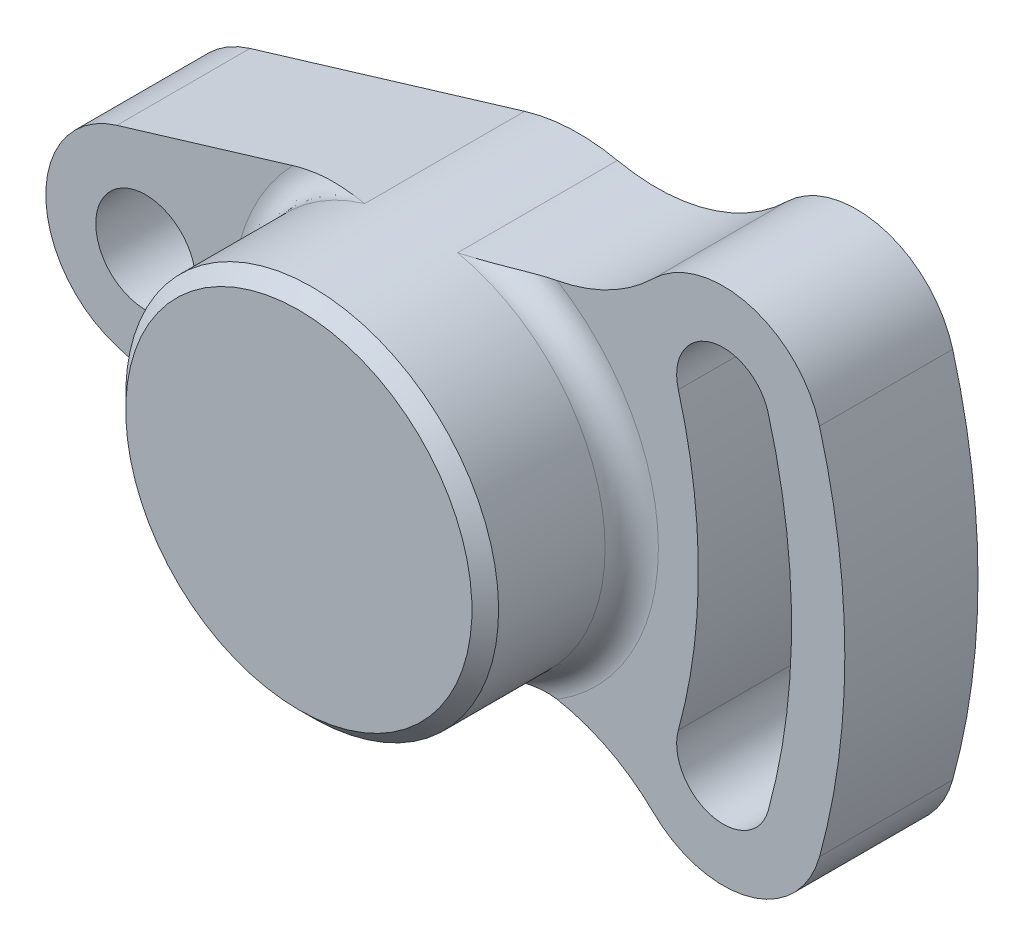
ISO-10303-21;
HEADER;
FILE_DESCRIPTION(('STEP AP214'),'2;1');
FILE_NAME('part.step','',(''),(''),'','','');
FILE_SCHEMA(('AUTOMOTIVE_DESIGN { 1 0 10303 214 1 1 1 1 }'));
ENDSEC;
DATA;
#1=APPLICATION_CONTEXT('core data for automotive mechanical design processes');
#2=APPLICATION_PROTOCOL_DEFINITION('international standard','automotive_design',2000,#1);
#3=PRODUCT_CONTEXT('',#1,'mechanical');
#4=PRODUCT('Part','Part','',(#3));
#5=PRODUCT_RELATED_PRODUCT_CATEGORY('part','',(#4));
#6=PRODUCT_DEFINITION_FORMATION('','',#4);
#7=PRODUCT_DEFINITION_CONTEXT('part definition',#1,'design');
#8=PRODUCT_DEFINITION('design','',#6,#7);
#9=PRODUCT_DEFINITION_SHAPE('','',#8);
#10=(LENGTH_UNIT() NAMED_UNIT(*) SI_UNIT(.MILLI.,.METRE.));
#11=(NAMED_UNIT(*) PLANE_ANGLE_UNIT() SI_UNIT($,.RADIAN.));
#12=(NAMED_UNIT(*) SI_UNIT($,.STERADIAN.) SOLID_ANGLE_UNIT());
#13=UNCERTAINTY_MEASURE_WITH_UNIT(LENGTH_MEASURE(1.E-05),#10,'distance_accuracy_value','');
#14=(GEOMETRIC_REPRESENTATION_CONTEXT(3) GLOBAL_UNCERTAINTY_ASSIGNED_CONTEXT((#13)) GLOBAL_UNIT_ASSIGNED_CONTEXT((#10,
#11,#12)) REPRESENTATION_CONTEXT('',''));
#15=CARTESIAN_POINT('',(0.,0.,0.));
#16=DIRECTION('',(0.,0.,1.));
#17=DIRECTION('',(1.,0.,0.));
#18=AXIS2_PLACEMENT_3D('',#15,#16,#17);
#19=CARTESIAN_POINT('',(22.5,0.,10.));
#20=DIRECTION('',(0.,0.,-1.));
#21=DIRECTION('',(0.,-1.,0.));
#22=AXIS2_PLACEMENT_3D('',#19,#20,#21);
#23=PLANE('',#22);
#24=CARTESIAN_POINT('',(0.,0.,10.));
#25=DIRECTION('',(0.,0.,1.));
#26=DIRECTION('',(0.,1.,0.));
#27=AXIS2_PLACEMENT_3D('',#24,#25,#26);
#28=CIRCLE('',#27,3.75);
#29=CARTESIAN_POINT('',(0.,3.75,10.));
#30=VERTEX_POINT('',#29);
#31=EDGE_CURVE('E176',#30,#30,#28,.T.);
#32=ORIENTED_EDGE('',*,*,#31,.F.);
#33=EDGE_LOOP('',(#32));
#34=FACE_BOUND('',#33,.T.);
#35=DIRECTION('',(0.957362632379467,-0.288888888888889,0.));
#36=VECTOR('',#35,1.);
#37=CARTESIAN_POINT('',(-2.16666666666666,-7.180219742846,10.));
#38=LINE('',#37,#36);
#39=CARTESIAN_POINT('',(-2.16666666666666,-7.180219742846,10.));
#40=VERTEX_POINT('',#39);
#41=CARTESIAN_POINT('',(11.0398564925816,-11.1653531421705,10.));
#42=VERTEX_POINT('',#41);
#43=EDGE_CURVE('E209',#40,#42,#38,.T.);
#44=ORIENTED_EDGE('',*,*,#43,.T.);
#45=CARTESIAN_POINT('',(22.5,0.,10.));
#46=DIRECTION('',(0.,0.,-1.));
#47=DIRECTION('',(0.,-1.,0.));
#48=AXIS2_PLACEMENT_3D('',#45,#46,#47);
#49=CIRCLE('',#48,16.);
#50=CARTESIAN_POINT('',(11.0398564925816,11.1653531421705,10.));
#51=VERTEX_POINT('',#50);
#52=EDGE_CURVE('E261',#42,#51,#49,.T.);
#53=ORIENTED_EDGE('',*,*,#52,.T.);
#54=DIRECTION('',(0.957362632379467,0.288888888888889,0.));
#55=VECTOR('',#54,1.);
#56=CARTESIAN_POINT('',(-2.16666666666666,7.180219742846,10.));
#57=LINE('',#56,#55);
#58=CARTESIAN_POINT('',(-2.16666666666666,7.180219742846,10.));
#59=VERTEX_POINT('',#58);
#60=EDGE_CURVE('E213',#59,#51,#57,.T.);
#61=ORIENTED_EDGE('',*,*,#60,.F.);
#62=CARTESIAN_POINT('',(0.,0.,10.));
#63=DIRECTION('',(0.,0.,1.));
#64=DIRECTION('',(0.,1.,0.));
#65=AXIS2_PLACEMENT_3D('',#62,#63,#64);
#66=CIRCLE('',#65,7.5);
#67=EDGE_CURVE('E210',#59,#40,#66,.T.);
#68=ORIENTED_EDGE('',*,*,#67,.T.);
#69=EDGE_LOOP('',(#44,#53,#61,#68));
#70=FACE_BOUND('',#69,.T.);
#71=ADVANCED_FACE('F14',(#34,#70),#23,.F.);
#72=CARTESIAN_POINT('',(0.,0.,10.));
#73=DIRECTION('',(0.,0.,1.));
#74=DIRECTION('',(0.,1.,0.));
#75=AXIS2_PLACEMENT_3D('',#72,#73,#74);
#76=CIRCLE('',#75,48.5);
#77=CARTESIAN_POINT('',(46.7437577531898,-12.9333333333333,10.));
#78=VERTEX_POINT('',#77);
#79=CARTESIAN_POINT('',(46.7437577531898,12.9333333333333,10.));
#80=VERTEX_POINT('',#79);
#81=EDGE_CURVE('E137',#78,#80,#76,.T.);
#82=ORIENTED_EDGE('',*,*,#81,.F.);
#83=CARTESIAN_POINT('',(43.3704968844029,-12.,10.));
#84=DIRECTION('',(0.,0.,-1.));
#85=DIRECTION('',(0.,-1.,0.));
#86=AXIS2_PLACEMENT_3D('',#83,#84,#85);
#87=CIRCLE('',#86,3.5);
#88=CARTESIAN_POINT('',(39.997236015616,-11.0666666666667,10.));
#89=VERTEX_POINT('',#88);
#90=EDGE_CURVE('E166',#78,#89,#87,.T.);
#91=ORIENTED_EDGE('',*,*,#90,.T.);
#92=CARTESIAN_POINT('',(0.,0.,10.));
#93=DIRECTION('',(0.,0.,1.));
#94=DIRECTION('',(0.,1.,0.));
#95=AXIS2_PLACEMENT_3D('',#92,#93,#94);
#96=CIRCLE('',#95,41.5);
#97=CARTESIAN_POINT('',(39.997236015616,11.0666666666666,10.));
#98=VERTEX_POINT('',#97);
#99=EDGE_CURVE('E163',#89,#98,#96,.T.);
#100=ORIENTED_EDGE('',*,*,#99,.T.);
#101=CARTESIAN_POINT('',(43.3704968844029,12.,10.));
#102=DIRECTION('',(0.,0.,1.));
#103=DIRECTION('',(0.,1.,0.));
#104=AXIS2_PLACEMENT_3D('',#101,#102,#103);
#105=CIRCLE('',#104,3.5);
#106=EDGE_CURVE('E161',#80,#98,#105,.T.);
#107=ORIENTED_EDGE('',*,*,#106,.F.);
#108=EDGE_LOOP('',(#82,#91,#100,#107));
#109=FACE_BOUND('',#108,.T.);
#110=CARTESIAN_POINT('',(28.3492696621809,27.3822213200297,10.));
#111=DIRECTION('',(0.,0.,1.));
#112=DIRECTION('',(0.,1.,0.));
#113=AXIS2_PLACEMENT_3D('',#110,#111,#112);
#114=CIRCLE('',#113,14.);
#115=CARTESIAN_POINT('',(30.9013562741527,13.616798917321,10.));
#116=VERTEX_POINT('',#115);
#117=CARTESIAN_POINT('',(38.1305338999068,17.3658911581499,10.));
#118=VERTEX_POINT('',#117);
#119=EDGE_CURVE('E218',#116,#118,#114,.T.);
#120=ORIENTED_EDGE('',*,*,#119,.F.);
#121=CARTESIAN_POINT('',(22.5,0.,10.));
#122=DIRECTION('',(0.,0.,-1.));
#123=DIRECTION('',(0.,-1.,0.));
#124=AXIS2_PLACEMENT_3D('',#121,#122,#123);
#125=CIRCLE('',#124,16.);
#126=CARTESIAN_POINT('',(30.9013562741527,-13.616798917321,10.));
#127=VERTEX_POINT('',#126);
#128=EDGE_CURVE('E41',#116,#127,#125,.T.);
#129=ORIENTED_EDGE('',*,*,#128,.T.);
#130=CARTESIAN_POINT('',(28.3492696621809,-27.3822213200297,10.));
#131=DIRECTION('',(0.,0.,-1.));
#132=DIRECTION('',(0.,-1.,0.));
#133=AXIS2_PLACEMENT_3D('',#130,#131,#132);
#134=CIRCLE('',#133,14.);
#135=CARTESIAN_POINT('',(38.1305338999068,-17.3658911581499,10.));
#136=VERTEX_POINT('',#135);
#137=EDGE_CURVE('E224',#127,#136,#134,.T.);
#138=ORIENTED_EDGE('',*,*,#137,.T.);
#139=CARTESIAN_POINT('',(43.3704968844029,-12.,10.));
#140=DIRECTION('',(0.,0.,-1.));
#141=DIRECTION('',(0.,-1.,0.));
#142=AXIS2_PLACEMENT_3D('',#139,#140,#141);
#143=CIRCLE('',#142,7.5);
#144=CARTESIAN_POINT('',(50.5989130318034,-14.,10.));
#145=VERTEX_POINT('',#144);
#146=EDGE_CURVE('E221',#145,#136,#143,.T.);
#147=ORIENTED_EDGE('',*,*,#146,.F.);
#148=CARTESIAN_POINT('',(0.,0.,10.));
#149=DIRECTION('',(0.,0.,1.));
#150=DIRECTION('',(0.,1.,0.));
#151=AXIS2_PLACEMENT_3D('',#148,#149,#150);
#152=CIRCLE('',#151,52.5);
#153=CARTESIAN_POINT('',(50.5989130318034,14.,10.));
#154=VERTEX_POINT('',#153);
#155=EDGE_CURVE('E217',#145,#154,#152,.T.);
#156=ORIENTED_EDGE('',*,*,#155,.T.);
#157=CARTESIAN_POINT('',(43.3704968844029,12.,10.));
#158=DIRECTION('',(0.,0.,1.));
#159=DIRECTION('',(0.,1.,0.));
#160=AXIS2_PLACEMENT_3D('',#157,#158,#159);
#161=CIRCLE('',#160,7.5);
#162=EDGE_CURVE('E214',#154,#118,#161,.T.);
#163=ORIENTED_EDGE('',*,*,#162,.T.);
#164=EDGE_LOOP('',(#120,#129,#138,#147,#156,#163));
#165=FACE_BOUND('',#164,.T.);
#166=ADVANCED_FACE('F322',(#109,#165),#23,.F.);
#167=CARTESIAN_POINT('',(22.5,0.,0.));
#168=DIRECTION('',(0.,0.,-1.));
#169=DIRECTION('',(0.,-1.,0.));
#170=AXIS2_PLACEMENT_3D('',#167,#168,#169);
#171=PLANE('',#170);
#172=CARTESIAN_POINT('',(0.,0.,0.));
#173=DIRECTION('',(0.,0.,1.));
#174=DIRECTION('',(0.,1.,0.));
#175=AXIS2_PLACEMENT_3D('',#172,#173,#174);
#176=CIRCLE('',#175,3.75);
#177=CARTESIAN_POINT('',(0.,3.75,0.));
#178=VERTEX_POINT('',#177);
#179=EDGE_CURVE('E141',#178,#178,#176,.T.);
#180=ORIENTED_EDGE('',*,*,#179,.T.);
#181=EDGE_LOOP('',(#180));
#182=FACE_BOUND('',#181,.T.);
#183=CARTESIAN_POINT('',(22.5,0.,0.));
#184=DIRECTION('',(0.,0.,-1.));
#185=DIRECTION('',(0.,-1.,0.));
#186=AXIS2_PLACEMENT_3D('',#183,#184,#185);
#187=CIRCLE('',#186,14.);
#188=CARTESIAN_POINT('',(25.4246348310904,-13.6911106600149,0.));
#189=VERTEX_POINT('',#188);
#190=CARTESIAN_POINT('',(18.4555555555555,-13.4030768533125,0.));
#191=VERTEX_POINT('',#190);
#192=EDGE_CURVE('E179',#189,#191,#187,.T.);
#193=ORIENTED_EDGE('',*,*,#192,.T.);
#194=DIRECTION('',(0.957362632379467,-0.288888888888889,0.));
#195=VECTOR('',#194,1.);
#196=CARTESIAN_POINT('',(-2.16666666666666,-7.180219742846,0.));
#197=LINE('',#196,#195);
#198=CARTESIAN_POINT('',(-2.16666666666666,-7.180219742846,0.));
#199=VERTEX_POINT('',#198);
#200=EDGE_CURVE('E182',#199,#191,#197,.T.);
#201=ORIENTED_EDGE('',*,*,#200,.F.);
#202=CARTESIAN_POINT('',(0.,0.,0.));
#203=DIRECTION('',(0.,0.,1.));
#204=DIRECTION('',(0.,1.,0.));
#205=AXIS2_PLACEMENT_3D('',#202,#203,#204);
#206=CIRCLE('',#205,7.5);
#207=CARTESIAN_POINT('',(-2.16666666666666,7.180219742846,0.));
#208=VERTEX_POINT('',#207);
#209=EDGE_CURVE('E185',#208,#199,#206,.T.);
#210=ORIENTED_EDGE('',*,*,#209,.F.);
#211=DIRECTION('',(0.957362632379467,0.288888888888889,0.));
#212=VECTOR('',#211,1.);
#213=CARTESIAN_POINT('',(-2.16666666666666,7.180219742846,0.));
#214=LINE('',#213,#212);
#215=CARTESIAN_POINT('',(18.4555555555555,13.4030768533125,0.));
#216=VERTEX_POINT('',#215);
#217=EDGE_CURVE('E188',#208,#216,#214,.T.);
#218=ORIENTED_EDGE('',*,*,#217,.T.);
#219=CARTESIAN_POINT('',(22.5,0.,0.));
#220=DIRECTION('',(0.,0.,1.));
#221=DIRECTION('',(0.,1.,0.));
#222=AXIS2_PLACEMENT_3D('',#219,#220,#221);
#223=CIRCLE('',#222,14.);
#224=CARTESIAN_POINT('',(25.4246348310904,13.6911106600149,0.));
#225=VERTEX_POINT('',#224);
#226=EDGE_CURVE('E191',#225,#216,#223,.T.);
#227=ORIENTED_EDGE('',*,*,#226,.F.);
#228=CARTESIAN_POINT('',(28.3492696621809,27.3822213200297,0.));
#229=DIRECTION('',(0.,0.,1.));
#230=DIRECTION('',(0.,1.,0.));
#231=AXIS2_PLACEMENT_3D('',#228,#229,#230);
#232=CIRCLE('',#231,14.);
#233=CARTESIAN_POINT('',(38.1305338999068,17.3658911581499,0.));
#234=VERTEX_POINT('',#233);
#235=EDGE_CURVE('E194',#225,#234,#232,.T.);
#236=ORIENTED_EDGE('',*,*,#235,.T.);
#237=CARTESIAN_POINT('',(43.3704968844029,12.,0.));
#238=DIRECTION('',(0.,0.,1.));
#239=DIRECTION('',(0.,1.,0.));
#240=AXIS2_PLACEMENT_3D('',#237,#238,#239);
#241=CIRCLE('',#240,7.5);
#242=CARTESIAN_POINT('',(50.5989130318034,14.,0.));
#243=VERTEX_POINT('',#242);
#244=EDGE_CURVE('E197',#243,#234,#241,.T.);
#245=ORIENTED_EDGE('',*,*,#244,.F.);
#246=CARTESIAN_POINT('',(0.,0.,0.));
#247=DIRECTION('',(0.,0.,1.));
#248=DIRECTION('',(0.,1.,0.));
#249=AXIS2_PLACEMENT_3D('',#246,#247,#248);
#250=CIRCLE('',#249,52.5);
#251=CARTESIAN_POINT('',(50.5989130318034,-14.,0.));
#252=VERTEX_POINT('',#251);
#253=EDGE_CURVE('E200',#252,#243,#250,.T.);
#254=ORIENTED_EDGE('',*,*,#253,.F.);
#255=CARTESIAN_POINT('',(43.3704968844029,-12.,0.));
#256=DIRECTION('',(0.,0.,-1.));
#257=DIRECTION('',(0.,-1.,0.));
#258=AXIS2_PLACEMENT_3D('',#255,#256,#257);
#259=CIRCLE('',#258,7.5);
#260=CARTESIAN_POINT('',(38.1305338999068,-17.3658911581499,0.));
#261=VERTEX_POINT('',#260);
#262=EDGE_CURVE('E203',#252,#261,#259,.T.);
#263=ORIENTED_EDGE('',*,*,#262,.T.);
#264=CARTESIAN_POINT('',(28.3492696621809,-27.3822213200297,0.));
#265=DIRECTION('',(0.,0.,-1.));
#266=DIRECTION('',(0.,-1.,0.));
#267=AXIS2_PLACEMENT_3D('',#264,#265,#266);
#268=CIRCLE('',#267,14.);
#269=EDGE_CURVE('E206',#189,#261,#268,.T.);
#270=ORIENTED_EDGE('',*,*,#269,.F.);
#271=EDGE_LOOP('',(#193,#201,#210,#218,#227,#236,#245,#254,#263,#270));
#272=FACE_BOUND('',#271,.T.);
#273=CARTESIAN_POINT('',(43.3704968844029,-12.,0.));
#274=DIRECTION('',(0.,0.,-1.));
#275=DIRECTION('',(0.,-1.,0.));
#276=AXIS2_PLACEMENT_3D('',#273,#274,#275);
#277=CIRCLE('',#276,3.5);
#278=CARTESIAN_POINT('',(46.7437577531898,-12.9333333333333,0.));
#279=VERTEX_POINT('',#278);
#280=CARTESIAN_POINT('',(39.997236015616,-11.0666666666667,0.));
#281=VERTEX_POINT('',#280);
#282=EDGE_CURVE('E155',#279,#281,#277,.T.);
#283=ORIENTED_EDGE('',*,*,#282,.F.);
#284=CARTESIAN_POINT('',(0.,0.,0.));
#285=DIRECTION('',(0.,0.,1.));
#286=DIRECTION('',(0.,1.,0.));
#287=AXIS2_PLACEMENT_3D('',#284,#285,#286);
#288=CIRCLE('',#287,48.5);
#289=CARTESIAN_POINT('',(46.7437577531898,12.9333333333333,0.));
#290=VERTEX_POINT('',#289);
#291=EDGE_CURVE('E134',#279,#290,#288,.T.);
#292=ORIENTED_EDGE('',*,*,#291,.T.);
#293=CARTESIAN_POINT('',(43.3704968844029,12.,0.));
#294=DIRECTION('',(0.,0.,1.));
#295=DIRECTION('',(0.,1.,0.));
#296=AXIS2_PLACEMENT_3D('',#293,#294,#295);
#297=CIRCLE('',#296,3.5);
#298=CARTESIAN_POINT('',(39.997236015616,11.0666666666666,0.));
#299=VERTEX_POINT('',#298);
#300=EDGE_CURVE('E145',#290,#299,#297,.T.);
#301=ORIENTED_EDGE('',*,*,#300,.T.);
#302=CARTESIAN_POINT('',(0.,0.,0.));
#303=DIRECTION('',(0.,0.,1.));
#304=DIRECTION('',(0.,1.,0.));
#305=AXIS2_PLACEMENT_3D('',#302,#303,#304);
#306=CIRCLE('',#305,41.5);
#307=EDGE_CURVE('E150',#281,#299,#306,.T.);
#308=ORIENTED_EDGE('',*,*,#307,.F.);
#309=EDGE_LOOP('',(#283,#292,#301,#308));
#310=FACE_BOUND('',#309,.T.);
#311=ADVANCED_FACE('F153',(#182,#272,#310),#171,.T.);
#312=CARTESIAN_POINT('',(28.3492696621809,-27.3822213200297,10.));
#313=DIRECTION('',(0.,0.,-1.));
#314=DIRECTION('',(0.,-1.,0.));
#315=AXIS2_PLACEMENT_3D('',#312,#313,#314);
#316=CYLINDRICAL_SURFACE('',#315,14.);
#317=DIRECTION('',(0.,0.,-1.));
#318=VECTOR('',#317,1.);
#319=CARTESIAN_POINT('',(38.1305338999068,-17.3658911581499,10.));
#320=LINE('',#319,#318);
#321=EDGE_CURVE('E238',#136,#261,#320,.T.);
#322=ORIENTED_EDGE('',*,*,#321,.F.);
#323=ORIENTED_EDGE('',*,*,#137,.F.);
#324=CARTESIAN_POINT('',(30.9013562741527,-13.616798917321,10.));
#325=CARTESIAN_POINT('',(30.8316840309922,-13.6038808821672,10.0000029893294));
#326=CARTESIAN_POINT('',(30.7619322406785,-13.5914971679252,10.0016972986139));
#327=CARTESIAN_POINT('',(30.6224148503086,-13.5678154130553,10.0082071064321));
#328=CARTESIAN_POINT('',(30.5526492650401,-13.5565169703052,10.0130214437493));
#329=CARTESIAN_POINT('',(30.3437962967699,-13.5243113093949,10.0317255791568));
#330=CARTESIAN_POINT('',(30.2048273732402,-13.5050335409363,10.0498789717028));
#331=CARTESIAN_POINT('',(29.9294153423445,-13.4709952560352,10.095501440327));
#332=CARTESIAN_POINT('',(29.7929609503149,-13.4561904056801,10.1228729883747));
#333=CARTESIAN_POINT('',(29.5214092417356,-13.430708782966,10.18549535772));
#334=CARTESIAN_POINT('',(29.3863129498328,-13.4200349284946,10.2207517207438));
#335=CARTESIAN_POINT('',(28.9921688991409,-13.3945664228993,10.333885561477));
#336=CARTESIAN_POINT('',(28.7353449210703,-13.3852518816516,10.4207892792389));
#337=CARTESIAN_POINT('',(28.2280980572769,-13.380443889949,10.611860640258));
#338=CARTESIAN_POINT('',(27.9776801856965,-13.3849609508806,10.7160413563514));
#339=CARTESIAN_POINT('',(27.4813416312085,-13.4069308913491,10.9368228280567));
#340=CARTESIAN_POINT('',(27.2354542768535,-13.4244565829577,11.0534903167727));
#341=CARTESIAN_POINT('',(26.7487789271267,-13.4718583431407,11.2943366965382));
#342=CARTESIAN_POINT('',(26.5079888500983,-13.5017292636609,11.4185124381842));
#343=CARTESIAN_POINT('',(26.1295350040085,-13.5585935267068,11.6183710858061));
#344=CARTESIAN_POINT('',(25.9905779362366,-13.5816288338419,11.692773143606));
#345=CARTESIAN_POINT('',(25.7139538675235,-13.6317722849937,11.8421524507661));
#346=CARTESIAN_POINT('',(25.576285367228,-13.6588748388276,11.9171287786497));
#347=CARTESIAN_POINT('',(25.4342564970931,-13.6890579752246,11.9947412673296));
#348=CARTESIAN_POINT('',(25.4294453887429,-13.6900830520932,11.9973706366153));
#349=CARTESIAN_POINT('',(25.4246348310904,-13.6911106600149,12.));
#350=B_SPLINE_CURVE_WITH_KNOTS('',3,(#324,#325,#326,#327,#328,#329,#330,#331,#332,#333,#334,
#335,#336,#337,#338,#339,#340,#341,#342,#343,#344,#345,#346,#347,#348,#349),.UNSPECIFIED.,.F.,
.F.,(4,2,2,2,2,2,2,2,2,2,2,2,4),(0.,0.212525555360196,0.424972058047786,0.84887607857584,
1.26842917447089,1.68827807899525,2.50073088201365,3.31380126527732,4.13145722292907,
4.94877255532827,5.42661458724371,5.9038057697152,5.92053897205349),.UNSPECIFIED.);
#351=CARTESIAN_POINT('',(25.4246348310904,-13.6911106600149,12.));
#352=VERTEX_POINT('',#351);
#353=EDGE_CURVE('E9',#127,#352,#350,.T.);
#354=ORIENTED_EDGE('',*,*,#353,.T.);
#355=DIRECTION('',(0.,0.,-1.));
#356=VECTOR('',#355,1.);
#357=CARTESIAN_POINT('',(25.4246348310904,-13.6911106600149,10.));
#358=LINE('',#357,#356);
#359=EDGE_CURVE('E240',#352,#189,#358,.T.);
#360=ORIENTED_EDGE('',*,*,#359,.T.);
#361=ORIENTED_EDGE('',*,*,#269,.T.);
#362=EDGE_LOOP('',(#322,#323,#354,#360,#361));
#363=FACE_BOUND('',#362,.T.);
#364=ADVANCED_FACE('F16',(#363),#316,.F.);
#365=CARTESIAN_POINT('',(43.3704968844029,-12.,10.));
#366=DIRECTION('',(0.,0.,-1.));
#367=DIRECTION('',(0.,-1.,0.));
#368=AXIS2_PLACEMENT_3D('',#365,#366,#367);
#369=CYLINDRICAL_SURFACE('',#368,7.5);
#370=DIRECTION('',(0.,0.,-1.));
#371=VECTOR('',#370,1.);
#372=CARTESIAN_POINT('',(50.5989130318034,-14.,10.));
#373=LINE('',#372,#371);
#374=EDGE_CURVE('E236',#145,#252,#373,.T.);
#375=ORIENTED_EDGE('',*,*,#374,.F.);
#376=ORIENTED_EDGE('',*,*,#146,.T.);
#377=ORIENTED_EDGE('',*,*,#321,.T.);
#378=ORIENTED_EDGE('',*,*,#262,.F.);
#379=EDGE_LOOP('',(#375,#376,#377,#378));
#380=FACE_BOUND('',#379,.T.);
#381=ADVANCED_FACE('F367',(#380),#369,.T.);
#382=CARTESIAN_POINT('',(0.,0.,10.));
#383=DIRECTION('',(0.,0.,-1.));
#384=DIRECTION('',(0.,-1.,0.));
#385=AXIS2_PLACEMENT_3D('',#382,#383,#384);
#386=CYLINDRICAL_SURFACE('',#385,52.5);
#387=DIRECTION('',(0.,0.,-1.));
#388=VECTOR('',#387,1.);
#389=CARTESIAN_POINT('',(50.5989130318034,14.,10.));
#390=LINE('',#389,#388);
#391=EDGE_CURVE('E233',#154,#243,#390,.T.);
#392=ORIENTED_EDGE('',*,*,#391,.F.);
#393=ORIENTED_EDGE('',*,*,#155,.F.);
#394=ORIENTED_EDGE('',*,*,#374,.T.);
#395=ORIENTED_EDGE('',*,*,#253,.T.);
#396=EDGE_LOOP('',(#392,#393,#394,#395));
#397=FACE_BOUND('',#396,.T.);
#398=ADVANCED_FACE('F371',(#397),#386,.T.);
#399=CARTESIAN_POINT('',(43.3704968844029,12.,10.));
#400=DIRECTION('',(0.,0.,-1.));
#401=DIRECTION('',(0.,-1.,0.));
#402=AXIS2_PLACEMENT_3D('',#399,#400,#401);
#403=CYLINDRICAL_SURFACE('',#402,7.5);
#404=DIRECTION('',(0.,0.,-1.));
#405=VECTOR('',#404,1.);
#406=CARTESIAN_POINT('',(38.1305338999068,17.3658911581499,10.));
#407=LINE('',#406,#405);
#408=EDGE_CURVE('E231',#118,#234,#407,.T.);
#409=ORIENTED_EDGE('',*,*,#408,.F.);
#410=ORIENTED_EDGE('',*,*,#162,.F.);
#411=ORIENTED_EDGE('',*,*,#391,.T.);
#412=ORIENTED_EDGE('',*,*,#244,.T.);
#413=EDGE_LOOP('',(#409,#410,#411,#412));
#414=FACE_BOUND('',#413,.T.);
#415=ADVANCED_FACE('F302',(#414),#403,.T.);
#416=CARTESIAN_POINT('',(28.3492696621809,27.3822213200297,10.));
#417=DIRECTION('',(0.,0.,-1.));
#418=DIRECTION('',(0.,-1.,0.));
#419=AXIS2_PLACEMENT_3D('',#416,#417,#418);
#420=CYLINDRICAL_SURFACE('',#419,14.);
#421=DIRECTION('',(0.,0.,-1.));
#422=VECTOR('',#421,1.);
#423=CARTESIAN_POINT('',(25.4246348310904,13.6911106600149,10.));
#424=LINE('',#423,#422);
#425=CARTESIAN_POINT('',(25.4246348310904,13.6911106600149,12.));
#426=VERTEX_POINT('',#425);
#427=EDGE_CURVE('E234',#426,#225,#424,.T.);
#428=ORIENTED_EDGE('',*,*,#427,.F.);
#429=CARTESIAN_POINT('',(30.9013562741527,13.616798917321,10.));
#430=CARTESIAN_POINT('',(30.8316840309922,13.6038808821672,10.0000029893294));
#431=CARTESIAN_POINT('',(30.7619322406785,13.5914971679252,10.0016972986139));
#432=CARTESIAN_POINT('',(30.6224148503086,13.5678154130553,10.0082071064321));
#433=CARTESIAN_POINT('',(30.5526492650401,13.5565169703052,10.0130214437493));
#434=CARTESIAN_POINT('',(30.3437962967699,13.5243113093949,10.0317255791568));
#435=CARTESIAN_POINT('',(30.2048273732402,13.5050335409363,10.0498789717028));
#436=CARTESIAN_POINT('',(29.9294153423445,13.4709952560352,10.095501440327));
#437=CARTESIAN_POINT('',(29.7929609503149,13.4561904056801,10.1228729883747));
#438=CARTESIAN_POINT('',(29.5214092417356,13.430708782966,10.18549535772));
#439=CARTESIAN_POINT('',(29.3863129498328,13.4200349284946,10.2207517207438));
#440=CARTESIAN_POINT('',(28.9921688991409,13.3945664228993,10.333885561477));
#441=CARTESIAN_POINT('',(28.7353449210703,13.3852518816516,10.4207892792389));
#442=CARTESIAN_POINT('',(28.2280980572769,13.380443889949,10.611860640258));
#443=CARTESIAN_POINT('',(27.9776801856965,13.3849609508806,10.7160413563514));
#444=CARTESIAN_POINT('',(27.4813416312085,13.4069308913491,10.9368228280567));
#445=CARTESIAN_POINT('',(27.2354542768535,13.4244565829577,11.0534903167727));
#446=CARTESIAN_POINT('',(26.7487789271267,13.4718583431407,11.2943366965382));
#447=CARTESIAN_POINT('',(26.5079888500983,13.5017292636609,11.4185124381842));
#448=CARTESIAN_POINT('',(26.1295350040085,13.5585935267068,11.6183710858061));
#449=CARTESIAN_POINT('',(25.9905779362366,13.5816288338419,11.692773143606));
#450=CARTESIAN_POINT('',(25.7139538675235,13.6317722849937,11.8421524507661));
#451=CARTESIAN_POINT('',(25.576285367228,13.6588748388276,11.9171287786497));
#452=CARTESIAN_POINT('',(25.4342564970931,13.6890579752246,11.9947412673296));
#453=CARTESIAN_POINT('',(25.4294453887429,13.6900830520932,11.9973706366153));
#454=CARTESIAN_POINT('',(25.4246348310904,13.6911106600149,12.));
#455=B_SPLINE_CURVE_WITH_KNOTS('',3,(#429,#430,#431,#432,#433,#434,#435,#436,#437,#438,#439,
#440,#441,#442,#443,#444,#445,#446,#447,#448,#449,#450,#451,#452,#453,#454),.UNSPECIFIED.,.F.,
.F.,(4,2,2,2,2,2,2,2,2,2,2,2,4),(0.,0.212525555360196,0.424972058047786,0.84887607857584,
1.26842917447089,1.68827807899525,2.50073088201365,3.31380126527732,4.13145722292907,
4.94877255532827,5.42661458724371,5.9038057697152,5.92053897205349),.UNSPECIFIED.);
#456=EDGE_CURVE('E28',#426,#116,#455,.F.);
#457=ORIENTED_EDGE('',*,*,#456,.T.);
#458=ORIENTED_EDGE('',*,*,#119,.T.);
#459=ORIENTED_EDGE('',*,*,#408,.T.);
#460=ORIENTED_EDGE('',*,*,#235,.F.);
#461=EDGE_LOOP('',(#428,#457,#458,#459,#460));
#462=FACE_BOUND('',#461,.T.);
#463=ADVANCED_FACE('F297',(#462),#420,.F.);
#464=CARTESIAN_POINT('',(22.5,0.,10.));
#465=DIRECTION('',(0.,0.,-1.));
#466=DIRECTION('',(0.,-1.,0.));
#467=AXIS2_PLACEMENT_3D('',#464,#465,#466);
#468=CYLINDRICAL_SURFACE('',#467,14.);
#469=CARTESIAN_POINT('',(22.5,0.,20.));
#470=DIRECTION('',(0.,0.,1.));
#471=DIRECTION('',(0.,1.,0.));
#472=AXIS2_PLACEMENT_3D('',#469,#470,#471);
#473=CIRCLE('',#472,14.);
#474=CARTESIAN_POINT('',(22.5,14.,20.));
#475=VERTEX_POINT('',#474);
#476=EDGE_CURVE('E347',#475,#475,#473,.F.);
#477=ORIENTED_EDGE('',*,*,#476,.T.);
#478=EDGE_LOOP('',(#477));
#479=FACE_BOUND('',#478,.T.);
#480=CARTESIAN_POINT('',(22.5,0.,12.));
#481=DIRECTION('',(0.,0.,-1.));
#482=DIRECTION('',(0.,-1.,0.));
#483=AXIS2_PLACEMENT_3D('',#480,#481,#482);
#484=CIRCLE('',#483,14.);
#485=CARTESIAN_POINT('',(18.4555555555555,13.4030768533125,12.));
#486=VERTEX_POINT('',#485);
#487=CARTESIAN_POINT('',(18.4555555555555,-13.4030768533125,12.));
#488=VERTEX_POINT('',#487);
#489=EDGE_CURVE('E340',#486,#488,#484,.F.);
#490=ORIENTED_EDGE('',*,*,#489,.T.);
#491=DIRECTION('',(0.,0.,-1.));
#492=VECTOR('',#491,1.);
#493=CARTESIAN_POINT('',(18.4555555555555,-13.4030768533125,10.));
#494=LINE('',#493,#492);
#495=EDGE_CURVE('E228',#488,#191,#494,.T.);
#496=ORIENTED_EDGE('',*,*,#495,.T.);
#497=ORIENTED_EDGE('',*,*,#192,.F.);
#498=ORIENTED_EDGE('',*,*,#359,.F.);
#499=CARTESIAN_POINT('',(22.5,0.,12.));
#500=DIRECTION('',(0.,0.,-1.));
#501=DIRECTION('',(0.,-1.,0.));
#502=AXIS2_PLACEMENT_3D('',#499,#500,#501);
#503=CIRCLE('',#502,14.);
#504=EDGE_CURVE('E342',#352,#426,#503,.F.);
#505=ORIENTED_EDGE('',*,*,#504,.T.);
#506=ORIENTED_EDGE('',*,*,#427,.T.);
#507=ORIENTED_EDGE('',*,*,#226,.T.);
#508=DIRECTION('',(0.,0.,-1.));
#509=VECTOR('',#508,1.);
#510=CARTESIAN_POINT('',(18.4555555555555,13.4030768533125,10.));
#511=LINE('',#510,#509);
#512=EDGE_CURVE('E230',#486,#216,#511,.T.);
#513=ORIENTED_EDGE('',*,*,#512,.F.);
#514=EDGE_LOOP('',(#490,#496,#497,#498,#505,#506,#507,#513));
#515=FACE_BOUND('',#514,.T.);
#516=ADVANCED_FACE('F293',(#479,#515),#468,.T.);
#517=CARTESIAN_POINT('',(-2.16666666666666,7.180219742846,10.));
#518=DIRECTION('',(-0.288888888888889,0.957362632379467,0.));
#519=DIRECTION('',(-0.957362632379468,-0.288888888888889,0.));
#520=AXIS2_PLACEMENT_3D('',#517,#518,#519);
#521=PLANE('',#520);
#522=DIRECTION('',(0.,0.,-1.));
#523=VECTOR('',#522,1.);
#524=CARTESIAN_POINT('',(-2.16666666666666,7.180219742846,10.));
#525=LINE('',#524,#523);
#526=EDGE_CURVE('E227',#59,#208,#525,.T.);
#527=ORIENTED_EDGE('',*,*,#526,.F.);
#528=ORIENTED_EDGE('',*,*,#60,.T.);
#529=CARTESIAN_POINT('',(11.0398564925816,11.1653531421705,10.));
#530=CARTESIAN_POINT('',(11.1902612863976,11.2107385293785,10.0000307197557));
#531=CARTESIAN_POINT('',(11.3406146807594,11.2561084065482,10.0043367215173));
#532=CARTESIAN_POINT('',(11.640865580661,11.3467105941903,10.02052077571));
#533=CARTESIAN_POINT('',(11.7907633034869,11.39194297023,10.0323943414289));
#534=CARTESIAN_POINT('',(12.0895336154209,11.4820983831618,10.0626972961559));
#535=CARTESIAN_POINT('',(12.2384078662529,11.5270219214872,10.0811092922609));
#536=CARTESIAN_POINT('',(12.5354114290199,11.6166442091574,10.1237132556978));
#537=CARTESIAN_POINT('',(12.6835406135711,11.6613429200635,10.1479061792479));
#538=CARTESIAN_POINT('',(13.1241035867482,11.7942849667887,10.2276298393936));
#539=CARTESIAN_POINT('',(13.4153115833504,11.8821584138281,10.2905947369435));
#540=CARTESIAN_POINT('',(13.9944019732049,12.0569017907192,10.4319899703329));
#541=CARTESIAN_POINT('',(14.2822816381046,12.1437708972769,10.5104321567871));
#542=CARTESIAN_POINT('',(14.8964940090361,12.3291125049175,10.6914064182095));
#543=CARTESIAN_POINT('',(15.2223237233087,12.42743322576,10.7957830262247));
#544=CARTESIAN_POINT('',(15.8704690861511,12.623014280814,11.0154527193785));
#545=CARTESIAN_POINT('',(16.1927854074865,12.7202748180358,11.1307436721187));
#546=CARTESIAN_POINT('',(17.157307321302,13.0113240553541,11.4875340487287));
#547=CARTESIAN_POINT('',(17.7958899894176,13.2040195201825,11.7395664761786));
#548=CARTESIAN_POINT('',(18.4414274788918,13.398813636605,11.9944222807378));
#549=CARTESIAN_POINT('',(18.4484915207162,13.4009452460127,11.9972111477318));
#550=CARTESIAN_POINT('',(18.4555555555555,13.4030768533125,12.));
#551=B_SPLINE_CURVE_WITH_KNOTS('',3,(#529,#530,#531,#532,#533,#534,#535,#536,#537,#538,#539,
#540,#541,#542,#543,#544,#545,#546,#547,#548,#549,#550),.UNSPECIFIED.,.F.,.F.,(4,2,2,2,2,2,2,2,
2,2,4),(0.,0.471174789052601,0.942070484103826,1.41172281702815,1.88145288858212,
2.81274087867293,3.74474472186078,4.81242552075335,5.8798981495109,8.01876013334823,
8.04242445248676),.UNSPECIFIED.);
#552=EDGE_CURVE('E269',#51,#486,#551,.T.);
#553=ORIENTED_EDGE('',*,*,#552,.T.);
#554=ORIENTED_EDGE('',*,*,#512,.T.);
#555=ORIENTED_EDGE('',*,*,#217,.F.);
#556=EDGE_LOOP('',(#527,#528,#553,#554,#555));
#557=FACE_BOUND('',#556,.T.);
#558=ADVANCED_FACE('F288',(#557),#521,.T.);
#559=CARTESIAN_POINT('',(0.,0.,10.));
#560=DIRECTION('',(0.,0.,-1.));
#561=DIRECTION('',(0.,-1.,0.));
#562=AXIS2_PLACEMENT_3D('',#559,#560,#561);
#563=CYLINDRICAL_SURFACE('',#562,7.5);
#564=DIRECTION('',(0.,0.,-1.));
#565=VECTOR('',#564,1.);
#566=CARTESIAN_POINT('',(-2.16666666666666,-7.180219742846,10.));
#567=LINE('',#566,#565);
#568=EDGE_CURVE('E225',#40,#199,#567,.T.);
#569=ORIENTED_EDGE('',*,*,#568,.F.);
#570=ORIENTED_EDGE('',*,*,#67,.F.);
#571=ORIENTED_EDGE('',*,*,#526,.T.);
#572=ORIENTED_EDGE('',*,*,#209,.T.);
#573=EDGE_LOOP('',(#569,#570,#571,#572));
#574=FACE_BOUND('',#573,.T.);
#575=ADVANCED_FACE('F284',(#574),#563,.T.);
#576=CARTESIAN_POINT('',(-2.16666666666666,-7.180219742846,10.));
#577=DIRECTION('',(0.288888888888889,0.957362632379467,0.));
#578=DIRECTION('',(-0.957362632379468,0.288888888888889,0.));
#579=AXIS2_PLACEMENT_3D('',#576,#577,#578);
#580=PLANE('',#579);
#581=ORIENTED_EDGE('',*,*,#43,.F.);
#582=ORIENTED_EDGE('',*,*,#568,.T.);
#583=ORIENTED_EDGE('',*,*,#200,.T.);
#584=ORIENTED_EDGE('',*,*,#495,.F.);
#585=CARTESIAN_POINT('',(11.0398564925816,-11.1653531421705,10.));
#586=CARTESIAN_POINT('',(11.1902612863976,-11.2107385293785,10.0000307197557));
#587=CARTESIAN_POINT('',(11.3406146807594,-11.2561084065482,10.0043367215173));
#588=CARTESIAN_POINT('',(11.640865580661,-11.3467105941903,10.02052077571));
#589=CARTESIAN_POINT('',(11.7907633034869,-11.39194297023,10.0323943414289));
#590=CARTESIAN_POINT('',(12.0895336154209,-11.4820983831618,10.0626972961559));
#591=CARTESIAN_POINT('',(12.2384078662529,-11.5270219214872,10.0811092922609));
#592=CARTESIAN_POINT('',(12.5354114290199,-11.6166442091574,10.1237132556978));
#593=CARTESIAN_POINT('',(12.6835406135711,-11.6613429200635,10.1479061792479));
#594=CARTESIAN_POINT('',(13.1241035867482,-11.7942849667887,10.2276298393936));
#595=CARTESIAN_POINT('',(13.4153115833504,-11.8821584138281,10.2905947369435));
#596=CARTESIAN_POINT('',(13.9944019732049,-12.0569017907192,10.4319899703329));
#597=CARTESIAN_POINT('',(14.2822816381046,-12.1437708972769,10.5104321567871));
#598=CARTESIAN_POINT('',(14.8964940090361,-12.3291125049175,10.6914064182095));
#599=CARTESIAN_POINT('',(15.2223237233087,-12.42743322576,10.7957830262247));
#600=CARTESIAN_POINT('',(15.8704690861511,-12.623014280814,11.0154527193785));
#601=CARTESIAN_POINT('',(16.1927854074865,-12.7202748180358,11.1307436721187));
#602=CARTESIAN_POINT('',(17.157307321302,-13.0113240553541,11.4875340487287));
#603=CARTESIAN_POINT('',(17.7958899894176,-13.2040195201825,11.7395664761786));
#604=CARTESIAN_POINT('',(18.4414274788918,-13.398813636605,11.9944222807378));
#605=CARTESIAN_POINT('',(18.4484915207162,-13.4009452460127,11.9972111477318));
#606=CARTESIAN_POINT('',(18.4555555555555,-13.4030768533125,12.));
#607=B_SPLINE_CURVE_WITH_KNOTS('',3,(#585,#586,#587,#588,#589,#590,#591,#592,#593,#594,#595,
#596,#597,#598,#599,#600,#601,#602,#603,#604,#605,#606),.UNSPECIFIED.,.F.,.F.,(4,2,2,2,2,2,2,2,
2,2,4),(0.,0.471174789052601,0.942070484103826,1.41172281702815,1.88145288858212,
2.81274087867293,3.74474472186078,4.81242552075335,5.8798981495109,8.01876013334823,
8.04242445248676),.UNSPECIFIED.);
#608=EDGE_CURVE('E260',#488,#42,#607,.F.);
#609=ORIENTED_EDGE('',*,*,#608,.T.);
#610=EDGE_LOOP('',(#581,#582,#583,#584,#609));
#611=FACE_BOUND('',#610,.T.);
#612=ADVANCED_FACE('F278',(#611),#580,.F.);
#613=CARTESIAN_POINT('',(0.,0.,10.));
#614=DIRECTION('',(0.,0.,-1.));
#615=DIRECTION('',(0.,-1.,0.));
#616=AXIS2_PLACEMENT_3D('',#613,#614,#615);
#617=CYLINDRICAL_SURFACE('',#616,3.75);
#618=ORIENTED_EDGE('',*,*,#31,.T.);
#619=EDGE_LOOP('',(#618));
#620=FACE_BOUND('',#619,.T.);
#621=ORIENTED_EDGE('',*,*,#179,.F.);
#622=EDGE_LOOP('',(#621));
#623=FACE_BOUND('',#622,.T.);
#624=ADVANCED_FACE('F283',(#620,#623),#617,.F.);
#625=CARTESIAN_POINT('',(0.,0.,10.));
#626=DIRECTION('',(0.,0.,-1.));
#627=DIRECTION('',(0.,-1.,0.));
#628=AXIS2_PLACEMENT_3D('',#625,#626,#627);
#629=CYLINDRICAL_SURFACE('',#628,48.5);
#630=DIRECTION('',(0.,0.,-1.));
#631=VECTOR('',#630,1.);
#632=CARTESIAN_POINT('',(46.7437577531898,12.9333333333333,10.));
#633=LINE('',#632,#631);
#634=EDGE_CURVE('E130',#80,#290,#633,.T.);
#635=ORIENTED_EDGE('',*,*,#634,.T.);
#636=ORIENTED_EDGE('',*,*,#291,.F.);
#637=DIRECTION('',(0.,0.,-1.));
#638=VECTOR('',#637,1.);
#639=CARTESIAN_POINT('',(46.7437577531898,-12.9333333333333,10.));
#640=LINE('',#639,#638);
#641=EDGE_CURVE('E169',#78,#279,#640,.T.);
#642=ORIENTED_EDGE('',*,*,#641,.F.);
#643=ORIENTED_EDGE('',*,*,#81,.T.);
#644=EDGE_LOOP('',(#635,#636,#642,#643));
#645=FACE_BOUND('',#644,.T.);
#646=ADVANCED_FACE('F132',(#645),#629,.F.);
#647=CARTESIAN_POINT('',(43.3704968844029,12.,10.));
#648=DIRECTION('',(0.,0.,-1.));
#649=DIRECTION('',(0.,-1.,0.));
#650=AXIS2_PLACEMENT_3D('',#647,#648,#649);
#651=CYLINDRICAL_SURFACE('',#650,3.5);
#652=DIRECTION('',(0.,0.,-1.));
#653=VECTOR('',#652,1.);
#654=CARTESIAN_POINT('',(39.997236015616,11.0666666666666,10.));
#655=LINE('',#654,#653);
#656=EDGE_CURVE('E142',#98,#299,#655,.T.);
#657=ORIENTED_EDGE('',*,*,#656,.T.);
#658=ORIENTED_EDGE('',*,*,#300,.F.);
#659=ORIENTED_EDGE('',*,*,#634,.F.);
#660=ORIENTED_EDGE('',*,*,#106,.T.);
#661=EDGE_LOOP('',(#657,#658,#659,#660));
#662=FACE_BOUND('',#661,.T.);
#663=ADVANCED_FACE('F146',(#662),#651,.F.);
#664=CARTESIAN_POINT('',(0.,0.,10.));
#665=DIRECTION('',(0.,0.,-1.));
#666=DIRECTION('',(0.,-1.,0.));
#667=AXIS2_PLACEMENT_3D('',#664,#665,#666);
#668=CYLINDRICAL_SURFACE('',#667,41.5);
#669=DIRECTION('',(0.,0.,-1.));
#670=VECTOR('',#669,1.);
#671=CARTESIAN_POINT('',(39.997236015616,-11.0666666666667,10.));
#672=LINE('',#671,#670);
#673=EDGE_CURVE('E171',#89,#281,#672,.T.);
#674=ORIENTED_EDGE('',*,*,#673,.T.);
#675=ORIENTED_EDGE('',*,*,#307,.T.);
#676=ORIENTED_EDGE('',*,*,#656,.F.);
#677=ORIENTED_EDGE('',*,*,#99,.F.);
#678=EDGE_LOOP('',(#674,#675,#676,#677));
#679=FACE_BOUND('',#678,.T.);
#680=ADVANCED_FACE('F397',(#679),#668,.T.);
#681=CARTESIAN_POINT('',(43.3704968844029,-12.,10.));
#682=DIRECTION('',(0.,0.,-1.));
#683=DIRECTION('',(0.,-1.,0.));
#684=AXIS2_PLACEMENT_3D('',#681,#682,#683);
#685=CYLINDRICAL_SURFACE('',#684,3.5);
#686=ORIENTED_EDGE('',*,*,#90,.F.);
#687=ORIENTED_EDGE('',*,*,#641,.T.);
#688=ORIENTED_EDGE('',*,*,#282,.T.);
#689=ORIENTED_EDGE('',*,*,#673,.F.);
#690=EDGE_LOOP('',(#686,#687,#688,#689));
#691=FACE_BOUND('',#690,.T.);
#692=ADVANCED_FACE('F400',(#691),#685,.F.);
#693=CARTESIAN_POINT('',(22.5,0.,21.));
#694=DIRECTION('',(0.,0.,1.));
#695=DIRECTION('',(0.,1.,0.));
#696=AXIS2_PLACEMENT_3D('',#693,#694,#695);
#697=PLANE('',#696);
#698=CARTESIAN_POINT('',(22.5,0.,21.));
#699=DIRECTION('',(0.,0.,1.));
#700=DIRECTION('',(0.,1.,0.));
#701=AXIS2_PLACEMENT_3D('',#698,#699,#700);
#702=CIRCLE('',#701,13.);
#703=CARTESIAN_POINT('',(22.5,13.,21.));
#704=VERTEX_POINT('',#703);
#705=EDGE_CURVE('E350',#704,#704,#702,.T.);
#706=ORIENTED_EDGE('',*,*,#705,.T.);
#707=EDGE_LOOP('',(#706));
#708=FACE_BOUND('',#707,.T.);
#709=ADVANCED_FACE('F404',(#708),#697,.T.);
#710=CARTESIAN_POINT('',(22.5,0.,21.));
#711=DIRECTION('',(0.,0.,-1.));
#712=DIRECTION('',(0.,-1.,0.));
#713=AXIS2_PLACEMENT_3D('',#710,#711,#712);
#714=CONICAL_SURFACE('',#713,13.,0.785398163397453);
#715=ORIENTED_EDGE('',*,*,#476,.F.);
#716=EDGE_LOOP('',(#715));
#717=FACE_BOUND('',#716,.T.);
#718=ORIENTED_EDGE('',*,*,#705,.F.);
#719=EDGE_LOOP('',(#718));
#720=FACE_BOUND('',#719,.T.);
#721=ADVANCED_FACE('F318',(#717,#720),#714,.T.);
#722=CARTESIAN_POINT('',(22.5,0.,12.));
#723=DIRECTION('',(0.,0.,-1.));
#724=DIRECTION('',(0.,-1.,0.));
#725=AXIS2_PLACEMENT_3D('',#722,#723,#724);
#726=TOROIDAL_SURFACE('',#725,16.,2.);
#727=ORIENTED_EDGE('',*,*,#552,.F.);
#728=ORIENTED_EDGE('',*,*,#52,.F.);
#729=ORIENTED_EDGE('',*,*,#608,.F.);
#730=ORIENTED_EDGE('',*,*,#489,.F.);
#731=EDGE_LOOP('',(#727,#728,#729,#730));
#732=FACE_BOUND('',#731,.T.);
#733=ADVANCED_FACE('F275',(#732),#726,.F.);
#734=CARTESIAN_POINT('',(22.5,0.,12.));
#735=DIRECTION('',(0.,0.,-1.));
#736=DIRECTION('',(0.,-1.,0.));
#737=AXIS2_PLACEMENT_3D('',#734,#735,#736);
#738=TOROIDAL_SURFACE('',#737,16.,2.);
#739=ORIENTED_EDGE('',*,*,#353,.F.);
#740=ORIENTED_EDGE('',*,*,#128,.F.);
#741=ORIENTED_EDGE('',*,*,#456,.F.);
#742=ORIENTED_EDGE('',*,*,#504,.F.);
#743=EDGE_LOOP('',(#739,#740,#741,#742));
#744=FACE_BOUND('',#743,.T.);
#745=ADVANCED_FACE('F308',(#744),#738,.F.);
#746=CLOSED_SHELL('',(#71,#166,#311,#364,#381,#398,#415,#463,#516,#558,#575,#612,#624,#646,#663,
#680,#692,#709,#721,#733,#745));
#747=MANIFOLD_SOLID_BREP('B1',#746);
#748=ADVANCED_BREP_SHAPE_REPRESENTATION('',(#18,#747),#14);
#749=SHAPE_DEFINITION_REPRESENTATION(#9,#748);
ENDSEC;
END-ISO-10303-21;
